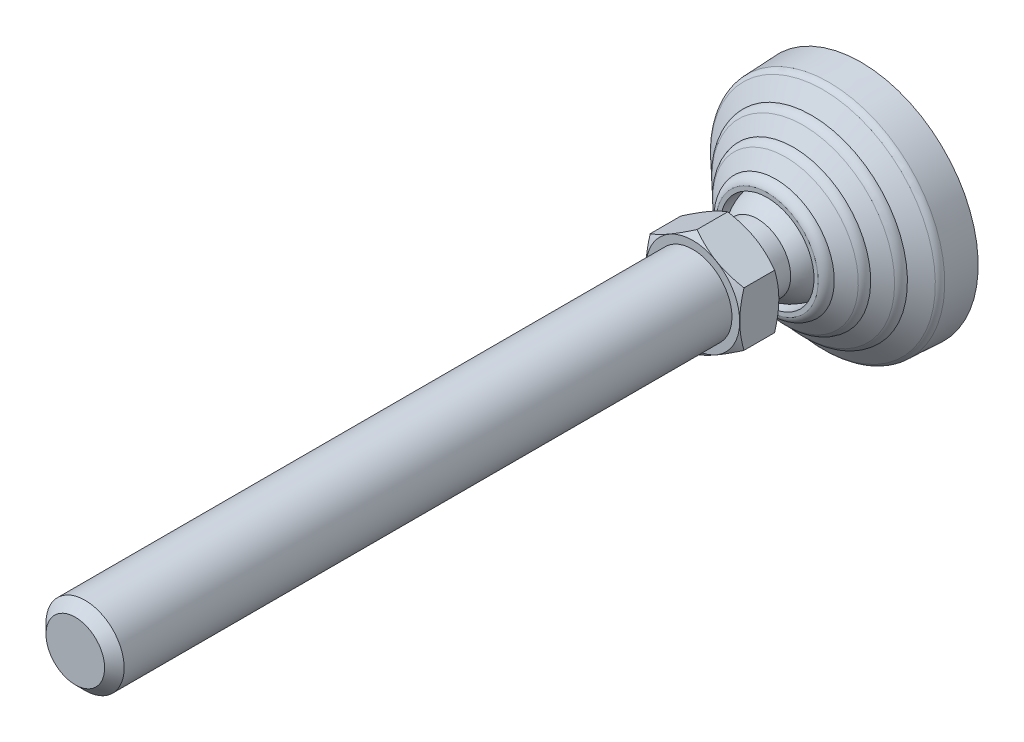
ISO-10303-21;
HEADER;
FILE_DESCRIPTION(('STEP AP214'),'2;1');
FILE_NAME('part.step','',(''),(''),'','','');
FILE_SCHEMA(('AUTOMOTIVE_DESIGN { 1 0 10303 214 1 1 1 1 }'));
ENDSEC;
DATA;
#1=APPLICATION_CONTEXT('core data for automotive mechanical design processes');
#2=APPLICATION_PROTOCOL_DEFINITION('international standard','automotive_design',2000,#1);
#3=PRODUCT_CONTEXT('',#1,'mechanical');
#4=PRODUCT('Part','Part','',(#3));
#5=PRODUCT_RELATED_PRODUCT_CATEGORY('part','',(#4));
#6=PRODUCT_DEFINITION_FORMATION('','',#4);
#7=PRODUCT_DEFINITION_CONTEXT('part definition',#1,'design');
#8=PRODUCT_DEFINITION('design','',#6,#7);
#9=PRODUCT_DEFINITION_SHAPE('','',#8);
#10=(LENGTH_UNIT() NAMED_UNIT(*) SI_UNIT(.MILLI.,.METRE.));
#11=(NAMED_UNIT(*) PLANE_ANGLE_UNIT() SI_UNIT($,.RADIAN.));
#12=(NAMED_UNIT(*) SI_UNIT($,.STERADIAN.) SOLID_ANGLE_UNIT());
#13=UNCERTAINTY_MEASURE_WITH_UNIT(LENGTH_MEASURE(1.E-05),#10,'distance_accuracy_value','');
#14=(GEOMETRIC_REPRESENTATION_CONTEXT(3) GLOBAL_UNCERTAINTY_ASSIGNED_CONTEXT((#13)) GLOBAL_UNIT_ASSIGNED_CONTEXT((#10,
#11,#12)) REPRESENTATION_CONTEXT('',''));
#15=CARTESIAN_POINT('',(0.,0.,0.));
#16=DIRECTION('',(0.,0.,1.));
#17=DIRECTION('',(1.,0.,0.));
#18=AXIS2_PLACEMENT_3D('',#15,#16,#17);
#19=CARTESIAN_POINT('',(0.,0.,110.4665));
#20=DIRECTION('',(0.,0.,-1.));
#21=DIRECTION('',(0.,1.,0.));
#22=AXIS2_PLACEMENT_3D('',#19,#20,#21);
#23=CYLINDRICAL_SURFACE('',#22,10.);
#24=CARTESIAN_POINT('',(0.,0.,198.5));
#25=DIRECTION('',(0.,0.,1.));
#26=DIRECTION('',(0.,-1.,0.));
#27=AXIS2_PLACEMENT_3D('',#24,#25,#26);
#28=CIRCLE('',#27,10.);
#29=CARTESIAN_POINT('',(0.,-10.,198.5));
#30=VERTEX_POINT('',#29);
#31=EDGE_CURVE('E9',#30,#30,#28,.F.);
#32=ORIENTED_EDGE('',*,*,#31,.T.);
#33=EDGE_LOOP('',(#32));
#34=FACE_BOUND('',#33,.T.);
#35=CARTESIAN_POINT('',(0.,0.,43.));
#36=DIRECTION('',(0.,0.,-1.));
#37=DIRECTION('',(0.,1.,0.));
#38=AXIS2_PLACEMENT_3D('',#35,#36,#37);
#39=CIRCLE('',#38,10.);
#40=CARTESIAN_POINT('',(0.,10.,43.));
#41=VERTEX_POINT('',#40);
#42=EDGE_CURVE('E124',#41,#41,#39,.F.);
#43=ORIENTED_EDGE('',*,*,#42,.T.);
#44=EDGE_LOOP('',(#43));
#45=FACE_BOUND('',#44,.T.);
#46=ADVANCED_FACE('F14',(#34,#45),#23,.T.);
#47=CARTESIAN_POINT('',(10.995,0.,43.));
#48=DIRECTION('',(0.,0.,1.));
#49=DIRECTION('',(0.,-1.,0.));
#50=AXIS2_PLACEMENT_3D('',#47,#48,#49);
#51=PLANE('',#50);
#52=CARTESIAN_POINT('',(0.,0.,43.));
#53=DIRECTION('',(0.,0.,-1.));
#54=DIRECTION('',(0.,1.,0.));
#55=AXIS2_PLACEMENT_3D('',#52,#53,#54);
#56=CIRCLE('',#55,11.99);
#57=CARTESIAN_POINT('',(0.,11.99,43.));
#58=VERTEX_POINT('',#57);
#59=EDGE_CURVE('E132',#58,#58,#56,.F.);
#60=ORIENTED_EDGE('',*,*,#59,.T.);
#61=EDGE_LOOP('',(#60));
#62=FACE_BOUND('',#61,.T.);
#63=ORIENTED_EDGE('',*,*,#42,.F.);
#64=EDGE_LOOP('',(#63));
#65=FACE_BOUND('',#64,.T.);
#66=ADVANCED_FACE('F157',(#62,#65),#51,.T.);
#67=CARTESIAN_POINT('',(0.,0.,41.9159643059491));
#68=DIRECTION('',(0.,0.,-1.));
#69=DIRECTION('',(0.,1.,0.));
#70=AXIS2_PLACEMENT_3D('',#67,#68,#69);
#71=CONICAL_SURFACE('',#70,13.8676048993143,1.0471975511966);
#72=ORIENTED_EDGE('',*,*,#59,.F.);
#73=EDGE_LOOP('',(#72));
#74=FACE_BOUND('',#73,.T.);
#75=CARTESIAN_POINT('',(-2.88482840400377E-08,-13.8564064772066,41.9224297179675));
#76=CARTESIAN_POINT('',(0.263784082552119,-13.7041106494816,42.0103407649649));
#77=CARTESIAN_POINT('',(0.528551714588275,-13.5512469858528,42.0942615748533));
#78=CARTESIAN_POINT('',(1.06021019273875,-13.2442938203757,42.2530155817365));
#79=CARTESIAN_POINT('',(1.32710170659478,-13.0902039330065,42.3278457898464));
#80=CARTESIAN_POINT('',(2.13207647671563,-12.6254515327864,42.537252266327));
#81=CARTESIAN_POINT('',(2.67333741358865,-12.3129543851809,42.6563603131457));
#82=CARTESIAN_POINT('',(3.48330954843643,-11.8453167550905,42.796023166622));
#83=CARTESIAN_POINT('',(3.74960108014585,-11.6915732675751,42.8358073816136));
#84=CARTESIAN_POINT('',(4.28341699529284,-11.3833745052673,42.9025217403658));
#85=CARTESIAN_POINT('',(4.55094140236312,-11.2289192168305,42.9294516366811));
#86=CARTESIAN_POINT('',(5.08643614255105,-10.9197511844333,42.9697675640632));
#87=CARTESIAN_POINT('',(5.35440556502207,-10.7650389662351,42.9831696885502));
#88=CARTESIAN_POINT('',(5.8905925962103,-10.4554712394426,42.996144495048));
#89=CARTESIAN_POINT('',(6.15881019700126,-10.3006157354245,42.9957176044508));
#90=CARTESIAN_POINT('',(6.66023029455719,-10.0111207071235,42.9820002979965));
#91=CARTESIAN_POINT('',(6.8934685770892,-9.87646052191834,42.97038309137));
#92=CARTESIAN_POINT('',(7.35940867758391,-9.60744987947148,42.9369099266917));
#93=CARTESIAN_POINT('',(7.59211045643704,-9.47309944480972,42.9150532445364));
#94=CARTESIAN_POINT('',(8.05685109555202,-9.20478131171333,42.8614821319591));
#95=CARTESIAN_POINT('',(8.28888924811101,-9.07081402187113,42.8297595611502));
#96=CARTESIAN_POINT('',(8.75187776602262,-8.80350747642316,42.7570131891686));
#97=CARTESIAN_POINT('',(8.9828280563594,-8.6701682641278,42.7159887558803));
#98=CARTESIAN_POINT('',(9.68388987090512,-8.26541003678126,42.5779256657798));
#99=CARTESIAN_POINT('',(10.1519713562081,-7.99516306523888,42.4671213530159));
#100=CARTESIAN_POINT('',(11.081155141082,-7.45869855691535,42.2156417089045));
#101=CARTESIAN_POINT('',(11.5422693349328,-7.19247415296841,42.075025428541));
#102=CARTESIAN_POINT('',(11.9999999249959,-6.92820327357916,41.922429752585));
#103=B_SPLINE_CURVE_WITH_KNOTS('',3,(#75,#76,#77,#78,#79,#80,#81,#82,#83,#84,#85,#86,#87,#88,
#89,#90,#91,#92,#93,#94,#95,#96,#97,#98,#99,#100,#101,#102),.UNSPECIFIED.,.F.,.F.,(4,2,2,2,2,2,
2,2,2,2,2,2,2,4),(0.,0.950996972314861,1.90230578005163,3.80897261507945,4.73890631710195,
5.66885791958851,6.59770188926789,7.52651715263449,8.33503482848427,9.14360968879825,
9.95285348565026,10.7621522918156,12.4163368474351,14.0672749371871),.UNSPECIFIED.);
#104=CARTESIAN_POINT('',(-1.44241383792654E-08,-13.8564064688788,41.9224297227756));
#105=VERTEX_POINT('',#104);
#106=CARTESIAN_POINT('',(12.,-6.92820324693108,41.9224297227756));
#107=VERTEX_POINT('',#106);
#108=EDGE_CURVE('E143',#105,#107,#103,.T.);
#109=ORIENTED_EDGE('',*,*,#108,.T.);
#110=CARTESIAN_POINT('',(12.,-6.92820326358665,41.9224297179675));
#111=CARTESIAN_POINT('',(12.,-6.64374493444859,42.0045333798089));
#112=CARTESIAN_POINT('',(12.,-6.35829458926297,42.0831531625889));
#113=CARTESIAN_POINT('',(12.,-5.78524260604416,42.2325348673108));
#114=CARTESIAN_POINT('',(12.,-5.49764024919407,42.3032940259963));
#115=CARTESIAN_POINT('',(12.,-4.63053083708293,42.5026195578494));
#116=CARTESIAN_POINT('',(12.,-4.04782834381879,42.6179071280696));
#117=CARTESIAN_POINT('',(12.,-3.17548925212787,42.7575170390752));
#118=CARTESIAN_POINT('',(12.,-2.88840964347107,42.7982045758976));
#119=CARTESIAN_POINT('',(12.,-2.31290718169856,42.8685767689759));
#120=CARTESIAN_POINT('',(12.,-2.02448443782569,42.8982623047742));
#121=CARTESIAN_POINT('',(12.,-1.44696804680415,42.9459902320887));
#122=CARTESIAN_POINT('',(12.,-1.15787537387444,42.9640443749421));
#123=CARTESIAN_POINT('',(12.,-0.579188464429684,42.9881624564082));
#124=CARTESIAN_POINT('',(12.,-0.289594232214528,42.994226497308));
#125=CARTESIAN_POINT('',(12.,0.289594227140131,42.9942264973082));
#126=CARTESIAN_POINT('',(12.,0.579188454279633,42.9881624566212));
#127=CARTESIAN_POINT('',(12.,1.15787535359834,42.9640443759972));
#128=CARTESIAN_POINT('',(12.,1.44696802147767,42.9459902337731));
#129=CARTESIAN_POINT('',(12.,2.02448440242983,42.8982623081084));
#130=CARTESIAN_POINT('',(12.,2.31290714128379,42.8685767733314));
#131=CARTESIAN_POINT('',(12.,2.88840959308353,42.798204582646));
#132=CARTESIAN_POINT('',(12.,3.17548919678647,42.7575170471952));
#133=CARTESIAN_POINT('',(12.,4.04782827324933,42.6179071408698));
#134=CARTESIAN_POINT('',(12.,4.63053075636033,42.5026195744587));
#135=CARTESIAN_POINT('',(12.,5.49764015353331,42.3032940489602));
#136=CARTESIAN_POINT('',(12.,5.78524250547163,42.2325348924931));
#137=CARTESIAN_POINT('',(12.,6.35829447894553,42.0831531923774));
#138=CARTESIAN_POINT('',(12.,6.64374481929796,42.004533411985));
#139=CARTESIAN_POINT('',(12.,6.92820314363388,41.9224297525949));
#140=B_SPLINE_CURVE_WITH_KNOTS('',3,(#110,#111,#112,#113,#114,#115,#116,#117,#118,#119,#120,
#121,#122,#123,#124,#125,#126,#127,#128,#129,#130,#131,#132,#133,#134,#135,#136,#137,#138,#139),
.UNSPECIFIED.,.F.,.F.,(4,2,2,2,2,2,2,2,2,2,2,2,2,2,4),(0.,0.888148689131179,1.77660860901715,
3.55698615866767,4.42666281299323,5.2962699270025,6.16499708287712,7.03371682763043,
7.90243655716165,8.7711636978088,9.64077079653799,10.5104474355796,12.2908249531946,
13.1792848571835,14.0674335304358),.UNSPECIFIED.);
#141=CARTESIAN_POINT('',(12.0000000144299,6.92820322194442,41.9224297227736));
#142=VERTEX_POINT('',#141);
#143=EDGE_CURVE('E135',#107,#142,#140,.T.);
#144=ORIENTED_EDGE('',*,*,#143,.T.);
#145=CARTESIAN_POINT('',(12.0000000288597,6.92820321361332,41.9224297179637));
#146=CARTESIAN_POINT('',(11.7362159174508,7.08049904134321,42.0103407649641));
#147=CARTESIAN_POINT('',(11.4714482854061,7.23336270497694,42.0942615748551));
#148=CARTESIAN_POINT('',(10.9397898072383,7.54031587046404,42.2530155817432));
#149=CARTESIAN_POINT('',(10.6728982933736,7.69440575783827,42.3278457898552));
#150=CARTESIAN_POINT('',(9.86792352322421,8.15915815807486,42.5372522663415));
#151=CARTESIAN_POINT('',(9.32666258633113,8.47165530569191,42.6563603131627));
#152=CARTESIAN_POINT('',(8.51669045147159,8.93929293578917,42.7960231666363));
#153=CARTESIAN_POINT('',(8.25039891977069,9.0930364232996,42.8358073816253));
#154=CARTESIAN_POINT('',(7.71658300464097,9.40123518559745,42.9025217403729));
#155=CARTESIAN_POINT('',(7.44905859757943,9.55569047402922,42.9294516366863));
#156=CARTESIAN_POINT('',(6.91356385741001,9.86485850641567,42.9697675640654));
#157=CARTESIAN_POINT('',(6.64559443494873,10.0195707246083,42.9831696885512));
#158=CARTESIAN_POINT('',(6.10940740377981,10.3291384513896,42.996144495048));
#159=CARTESIAN_POINT('',(5.84118980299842,10.4839939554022,42.9957176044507));
#160=CARTESIAN_POINT('',(5.33976970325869,10.773488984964,42.9820002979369));
#161=CARTESIAN_POINT('',(5.10653141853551,10.9081491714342,42.970383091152));
#162=CARTESIAN_POINT('',(4.64059131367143,11.1771598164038,42.9369099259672));
#163=CARTESIAN_POINT('',(4.4078895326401,11.3115102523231,42.9150532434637));
#164=CARTESIAN_POINT('',(3.94314888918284,11.5798283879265,42.8614821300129));
#165=CARTESIAN_POINT('',(3.71111073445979,11.7137956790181,42.8297595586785));
#166=CARTESIAN_POINT('',(3.24812221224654,11.9811022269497,42.7570131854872));
#167=CARTESIAN_POINT('',(3.01717191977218,12.1144414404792,42.7159887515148));
#168=CARTESIAN_POINT('',(2.31611009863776,12.5191996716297,42.5779256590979));
#169=CARTESIAN_POINT('',(1.84802860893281,12.7894466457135,42.4671213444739));
#170=CARTESIAN_POINT('',(0.918844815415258,13.3259111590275,42.2156416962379));
#171=CARTESIAN_POINT('',(0.457730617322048,13.5921355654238,42.0750254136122));
#172=CARTESIAN_POINT('',(2.30778996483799E-08,13.856406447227,41.9224297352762));
#173=B_SPLINE_CURVE_WITH_KNOTS('',3,(#145,#146,#147,#148,#149,#150,#151,#152,#153,#154,#155,
#156,#157,#158,#159,#160,#161,#162,#163,#164,#165,#166,#167,#168,#169,#170,#171,#172),
.UNSPECIFIED.,.F.,.F.,(4,2,2,2,2,2,2,2,2,2,2,2,2,4),(0.,0.95099697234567,1.9023057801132,
3.8089726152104,4.73890631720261,5.66885791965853,6.59770188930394,7.52651715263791,
8.33503483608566,9.14360970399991,9.95285350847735,10.7621523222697,12.4163368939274,
14.0672749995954),.UNSPECIFIED.);
#174=CARTESIAN_POINT('',(-1.15389591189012E-08,13.856406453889,41.92242973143));
#175=VERTEX_POINT('',#174);
#176=EDGE_CURVE('E180',#142,#175,#173,.T.);
#177=ORIENTED_EDGE('',*,*,#176,.T.);
#178=CARTESIAN_POINT('',(-2.30779115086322E-08,13.856406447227,41.9224297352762));
#179=CARTESIAN_POINT('',(-0.263784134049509,13.7041106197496,42.0103407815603));
#180=CARTESIAN_POINT('',(-0.528551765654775,13.5512469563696,42.0942615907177));
#181=CARTESIAN_POINT('',(-1.06021024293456,13.2442937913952,42.2530155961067));
#182=CARTESIAN_POINT('',(-1.32710175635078,13.0902039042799,42.3278458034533));
#183=CARTESIAN_POINT('',(-2.13207652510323,12.6254515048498,42.5372522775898));
#184=CARTESIAN_POINT('',(-2.6733374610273,12.3129543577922,42.656360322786));
#185=CARTESIAN_POINT('',(-3.48330959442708,11.8453167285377,42.7960231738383));
#186=CARTESIAN_POINT('',(-3.74960112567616,11.6915732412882,42.8358073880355));
#187=CARTESIAN_POINT('',(-4.28341703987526,11.3833744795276,42.9025217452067));
#188=CARTESIAN_POINT('',(-4.550941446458,11.2289191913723,42.9294516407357));
#189=CARTESIAN_POINT('',(-5.08643618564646,10.9197511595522,42.9697675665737));
#190=CARTESIAN_POINT('',(-5.35440560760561,10.7650389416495,42.9831696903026));
#191=CARTESIAN_POINT('',(-5.89059263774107,10.4554712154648,42.9961444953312));
#192=CARTESIAN_POINT('',(-6.15881023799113,10.300615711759,42.9957176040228));
#193=CARTESIAN_POINT('',(-6.66023033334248,10.0111206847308,42.9820002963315));
#194=CARTESIAN_POINT('',(-6.89346861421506,9.87646050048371,42.9703830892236));
#195=CARTESIAN_POINT('',(-7.359408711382,9.60744985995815,42.9369099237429));
#196=CARTESIAN_POINT('',(-7.59211048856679,9.4730994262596,42.9150532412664));
#197=CARTESIAN_POINT('',(-8.05685112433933,9.20478129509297,42.8614821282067));
#198=CARTESIAN_POINT('',(-8.28888927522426,9.07081400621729,42.8297595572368));
#199=CARTESIAN_POINT('',(-8.75187778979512,8.8035074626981,42.7570131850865));
#200=CARTESIAN_POINT('',(-8.98282807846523,8.67016825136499,42.7159887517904));
#201=CARTESIAN_POINT('',(-9.68388988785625,8.26541002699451,42.5779256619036));
#202=CARTESIAN_POINT('',(-10.1519713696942,7.9951630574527,42.4671213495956));
#203=CARTESIAN_POINT('',(-11.0811551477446,7.45869855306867,42.2156417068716));
#204=CARTESIAN_POINT('',(-11.5422693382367,7.19247415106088,42.0750254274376));
#205=CARTESIAN_POINT('',(-11.9999999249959,6.92820327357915,41.922429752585));
#206=B_SPLINE_CURVE_WITH_KNOTS('',3,(#178,#179,#180,#181,#182,#183,#184,#185,#186,#187,#188,
#189,#190,#191,#192,#193,#194,#195,#196,#197,#198,#199,#200,#201,#202,#203,#204,#205),
.UNSPECIFIED.,.F.,.F.,(4,2,2,2,2,2,2,2,2,2,2,2,2,4),(0.,0.9509969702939,1.90230577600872,
3.80897260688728,4.73890630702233,5.6688579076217,6.59770187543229,7.52651713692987,
8.33503480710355,9.14360966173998,9.95285345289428,10.7621522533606,12.4163367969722,
14.0672748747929),.UNSPECIFIED.);
#207=CARTESIAN_POINT('',(-12.,6.92820324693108,41.9224297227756));
#208=VERTEX_POINT('',#207);
#209=EDGE_CURVE('E172',#175,#208,#206,.T.);
#210=ORIENTED_EDGE('',*,*,#209,.T.);
#211=CARTESIAN_POINT('',(-12.,6.92820326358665,41.9224297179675));
#212=CARTESIAN_POINT('',(-12.,6.64374493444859,42.0045333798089));
#213=CARTESIAN_POINT('',(-12.,6.35829458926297,42.0831531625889));
#214=CARTESIAN_POINT('',(-12.,5.78524260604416,42.2325348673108));
#215=CARTESIAN_POINT('',(-12.,5.49764024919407,42.3032940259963));
#216=CARTESIAN_POINT('',(-12.,4.63053083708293,42.5026195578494));
#217=CARTESIAN_POINT('',(-12.,4.04782834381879,42.6179071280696));
#218=CARTESIAN_POINT('',(-12.,3.17548925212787,42.7575170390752));
#219=CARTESIAN_POINT('',(-12.,2.88840964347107,42.7982045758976));
#220=CARTESIAN_POINT('',(-12.,2.31290718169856,42.8685767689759));
#221=CARTESIAN_POINT('',(-12.,2.02448443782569,42.8982623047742));
#222=CARTESIAN_POINT('',(-12.,1.44696804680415,42.9459902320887));
#223=CARTESIAN_POINT('',(-12.,1.15787537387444,42.9640443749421));
#224=CARTESIAN_POINT('',(-12.,0.579188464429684,42.9881624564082));
#225=CARTESIAN_POINT('',(-12.,0.289594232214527,42.994226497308));
#226=CARTESIAN_POINT('',(-12.,-0.289594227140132,42.9942264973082));
#227=CARTESIAN_POINT('',(-12.,-0.579188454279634,42.9881624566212));
#228=CARTESIAN_POINT('',(-12.,-1.15787535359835,42.9640443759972));
#229=CARTESIAN_POINT('',(-12.,-1.44696802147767,42.9459902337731));
#230=CARTESIAN_POINT('',(-12.,-2.02448440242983,42.8982623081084));
#231=CARTESIAN_POINT('',(-12.,-2.31290714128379,42.8685767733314));
#232=CARTESIAN_POINT('',(-12.,-2.88840959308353,42.798204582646));
#233=CARTESIAN_POINT('',(-12.,-3.17548919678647,42.7575170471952));
#234=CARTESIAN_POINT('',(-12.,-4.04782827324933,42.6179071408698));
#235=CARTESIAN_POINT('',(-12.,-4.63053075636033,42.5026195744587));
#236=CARTESIAN_POINT('',(-12.,-5.49764015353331,42.3032940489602));
#237=CARTESIAN_POINT('',(-12.,-5.78524250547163,42.2325348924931));
#238=CARTESIAN_POINT('',(-12.,-6.35829447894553,42.0831531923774));
#239=CARTESIAN_POINT('',(-12.,-6.64374481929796,42.004533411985));
#240=CARTESIAN_POINT('',(-12.,-6.92820314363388,41.9224297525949));
#241=B_SPLINE_CURVE_WITH_KNOTS('',3,(#211,#212,#213,#214,#215,#216,#217,#218,#219,#220,#221,
#222,#223,#224,#225,#226,#227,#228,#229,#230,#231,#232,#233,#234,#235,#236,#237,#238,#239,#240),
.UNSPECIFIED.,.F.,.F.,(4,2,2,2,2,2,2,2,2,2,2,2,2,2,4),(0.,0.888148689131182,1.77660860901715,
3.55698615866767,4.42666281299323,5.2962699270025,6.16499708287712,7.03371682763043,
7.90243655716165,8.7711636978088,9.64077079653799,10.5104474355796,12.2908249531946,
13.1792848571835,14.0674335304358),.UNSPECIFIED.);
#242=CARTESIAN_POINT('',(-12.0000000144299,-6.92820322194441,41.9224297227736));
#243=VERTEX_POINT('',#242);
#244=EDGE_CURVE('E342',#208,#243,#241,.T.);
#245=ORIENTED_EDGE('',*,*,#244,.T.);
#246=CARTESIAN_POINT('',(-12.0000000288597,-6.92820321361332,41.9224297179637));
#247=CARTESIAN_POINT('',(-11.7362159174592,-7.08049904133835,42.0103407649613));
#248=CARTESIAN_POINT('',(-11.471448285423,-7.23336270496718,42.0942615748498));
#249=CARTESIAN_POINT('',(-10.9397898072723,-7.54031587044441,42.2530155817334));
#250=CARTESIAN_POINT('',(-10.6728982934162,-7.69440575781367,42.3278457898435));
#251=CARTESIAN_POINT('',(-9.86792352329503,-8.15915815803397,42.5372522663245));
#252=CARTESIAN_POINT('',(-9.3266625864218,-8.47165530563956,42.6563603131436));
#253=CARTESIAN_POINT('',(-8.5166904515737,-8.93929293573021,42.7960231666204));
#254=CARTESIAN_POINT('',(-8.25039891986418,-9.09303642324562,42.8358073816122));
#255=CARTESIAN_POINT('',(-7.71658300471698,-9.40123518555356,42.9025217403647));
#256=CARTESIAN_POINT('',(-7.44905859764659,-9.55569047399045,42.9294516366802));
#257=CARTESIAN_POINT('',(-6.91356385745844,-9.8648585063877,42.9697675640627));
#258=CARTESIAN_POINT('',(-6.64559443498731,-10.019570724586,42.9831696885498));
#259=CARTESIAN_POINT('',(-6.10940740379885,-10.3291384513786,42.996144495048));
#260=CARTESIAN_POINT('',(-5.84118980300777,-10.4839939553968,42.9957176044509));
#261=CARTESIAN_POINT('',(-5.33976970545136,-10.7734889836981,42.9820002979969));
#262=CARTESIAN_POINT('',(-5.10653142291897,-10.9081491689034,42.9703830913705));
#263=CARTESIAN_POINT('',(-4.64059132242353,-11.1771598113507,42.9369099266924));
#264=CARTESIAN_POINT('',(-4.40788954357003,-11.3115102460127,42.9150532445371));
#265=CARTESIAN_POINT('',(-3.94314890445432,-11.5798283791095,42.8614821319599));
#266=CARTESIAN_POINT('',(-3.71111075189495,-11.7137956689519,42.829759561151));
#267=CARTESIAN_POINT('',(-3.24812223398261,-11.9811022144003,42.7570131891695));
#268=CARTESIAN_POINT('',(-3.01717194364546,-12.1144414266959,42.7159887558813));
#269=CARTESIAN_POINT('',(-2.3161101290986,-12.5191996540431,42.5779256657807));
#270=CARTESIAN_POINT('',(-1.84802864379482,-12.7894466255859,42.4671213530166));
#271=CARTESIAN_POINT('',(-0.918844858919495,-13.3259111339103,42.215641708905));
#272=CARTESIAN_POINT('',(-0.457730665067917,-13.5921355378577,42.0750254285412));
#273=CARTESIAN_POINT('',(-7.50040961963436E-08,-13.8564064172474,41.922429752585));
#274=B_SPLINE_CURVE_WITH_KNOTS('',3,(#246,#247,#248,#249,#250,#251,#252,#253,#254,#255,#256,
#257,#258,#259,#260,#261,#262,#263,#264,#265,#266,#267,#268,#269,#270,#271,#272,#273),
.UNSPECIFIED.,.F.,.F.,(4,2,2,2,2,2,2,2,2,2,2,2,2,4),(0.,0.950996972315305,1.90230578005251,
3.80897261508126,4.73890631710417,5.66885791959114,6.59770188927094,7.52651715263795,
8.33503482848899,9.14360968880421,9.95285348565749,10.7621522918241,12.4163368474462,
14.0672749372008),.UNSPECIFIED.);
#275=EDGE_CURVE('E162',#243,#105,#274,.T.);
#276=ORIENTED_EDGE('',*,*,#275,.T.);
#277=EDGE_LOOP('',(#109,#144,#177,#210,#245,#276));
#278=FACE_BOUND('',#277,.T.);
#279=ADVANCED_FACE('F152',(#74,#278),#71,.T.);
#280=CARTESIAN_POINT('',(0.,-13.856406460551,43.1));
#281=DIRECTION('',(0.5,0.866025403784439,0.));
#282=DIRECTION('',(-0.866025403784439,0.5,0.));
#283=AXIS2_PLACEMENT_3D('',#280,#281,#282);
#284=PLANE('',#283);
#285=DIRECTION('',(0.,0.,1.));
#286=VECTOR('',#285,1.);
#287=CARTESIAN_POINT('',(0.,-13.856406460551,43.1));
#288=LINE('',#287,#286);
#289=CARTESIAN_POINT('',(0.,-13.856406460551,34.0775702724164));
#290=VERTEX_POINT('',#289);
#291=EDGE_CURVE('E368',#290,#105,#288,.T.);
#292=ORIENTED_EDGE('',*,*,#291,.T.);
#293=ORIENTED_EDGE('',*,*,#275,.F.);
#294=DIRECTION('',(0.,0.,1.));
#295=VECTOR('',#294,1.);
#296=CARTESIAN_POINT('',(-12.,-6.9282032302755,43.1));
#297=LINE('',#296,#295);
#298=CARTESIAN_POINT('',(-12.,-6.9282032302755,34.0775702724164));
#299=VERTEX_POINT('',#298);
#300=EDGE_CURVE('E360',#299,#243,#297,.T.);
#301=ORIENTED_EDGE('',*,*,#300,.F.);
#302=CARTESIAN_POINT('',(0.,-13.856406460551,34.0775702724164));
#303=CARTESIAN_POINT('',(-0.263784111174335,-13.7041106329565,33.9896592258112));
#304=CARTESIAN_POINT('',(-0.528551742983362,-13.5512469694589,33.9057384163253));
#305=CARTESIAN_POINT('',(-1.0602102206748,-13.2442938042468,33.7469844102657));
#306=CARTESIAN_POINT('',(-1.32710173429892,-13.0902039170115,33.6721542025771));
#307=CARTESIAN_POINT('',(-2.13207650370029,-12.6254515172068,33.4627477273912));
#308=CARTESIAN_POINT('',(-2.67333744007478,-12.3129543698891,33.3436396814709));
#309=CARTESIAN_POINT('',(-3.48330957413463,-11.8453167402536,33.2039768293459));
#310=CARTESIAN_POINT('',(-3.74960110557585,-11.6915732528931,33.1641926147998));
#311=CARTESIAN_POINT('',(-4.28341702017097,-11.3833744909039,33.097478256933));
#312=CARTESIAN_POINT('',(-4.55094142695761,-11.2289192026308,33.0705483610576));
#313=CARTESIAN_POINT('',(-5.08643616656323,-10.9197511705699,33.0302324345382));
#314=CARTESIAN_POINT('',(-5.35440558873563,-10.765038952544,33.0168303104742));
#315=CARTESIAN_POINT('',(-5.89059261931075,-10.4554712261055,33.0038555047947));
#316=CARTESIAN_POINT('',(-6.15881021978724,-10.300615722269,33.0042823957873));
#317=CARTESIAN_POINT('',(-6.66023031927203,-10.0111206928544,33.0179997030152));
#318=CARTESIAN_POINT('',(-6.8934686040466,-9.87646050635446,33.029616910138));
#319=CARTESIAN_POINT('',(-7.35940870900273,-9.6074498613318,33.063090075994));
#320=CARTESIAN_POINT('',(-7.59211049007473,-9.47309942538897,33.0849467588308));
#321=CARTESIAN_POINT('',(-8.05685113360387,-9.20478128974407,33.1385178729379));
#322=CARTESIAN_POINT('',(-8.28888928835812,-9.07081399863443,33.1702404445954));
#323=CARTESIAN_POINT('',(-8.75187781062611,-8.8035074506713,33.2429868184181));
#324=CARTESIAN_POINT('',(-8.98282810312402,-8.67016823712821,33.2840112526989));
#325=CARTESIAN_POINT('',(-9.6838899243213,-8.2654100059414,33.4220743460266));
#326=CARTESIAN_POINT('',(-10.1519714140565,-7.99516303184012,33.5328786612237));
#327=CARTESIAN_POINT('',(-11.0811552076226,-7.45869851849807,33.7843583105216));
#328=CARTESIAN_POINT('',(-11.5422694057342,-7.19247411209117,33.924974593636));
#329=CARTESIAN_POINT('',(-12.,-6.9282032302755,34.0775702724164));
#330=B_SPLINE_CURVE_WITH_KNOTS('',3,(#302,#303,#304,#305,#306,#307,#308,#309,#310,#311,#312,
#313,#314,#315,#316,#317,#318,#319,#320,#321,#322,#323,#324,#325,#326,#327,#328,#329),
.UNSPECIFIED.,.F.,.F.,(4,2,2,2,2,2,2,2,2,2,2,2,2,4),(0.,0.950996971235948,1.90230577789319,
3.80897261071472,4.73890631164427,5.66885791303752,6.59770188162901,7.52651714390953,
8.33503482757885,9.14360969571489,9.9528535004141,10.7621523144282,12.4163368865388,
14.0672749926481),.UNSPECIFIED.);
#331=EDGE_CURVE('E362',#290,#299,#330,.T.);
#332=ORIENTED_EDGE('',*,*,#331,.F.);
#333=EDGE_LOOP('',(#292,#293,#301,#332));
#334=FACE_BOUND('',#333,.T.);
#335=ADVANCED_FACE('F156',(#334),#284,.F.);
#336=CARTESIAN_POINT('',(12.,-6.92820323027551,43.1));
#337=DIRECTION('',(-0.5,0.866025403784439,0.));
#338=DIRECTION('',(-0.866025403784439,-0.5,0.));
#339=AXIS2_PLACEMENT_3D('',#336,#337,#338);
#340=PLANE('',#339);
#341=DIRECTION('',(0.,0.,1.));
#342=VECTOR('',#341,1.);
#343=CARTESIAN_POINT('',(12.,-6.92820323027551,43.1));
#344=LINE('',#343,#342);
#345=CARTESIAN_POINT('',(12.,-6.92820323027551,34.0775702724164));
#346=VERTEX_POINT('',#345);
#347=EDGE_CURVE('E31',#346,#107,#344,.T.);
#348=ORIENTED_EDGE('',*,*,#347,.T.);
#349=ORIENTED_EDGE('',*,*,#108,.F.);
#350=ORIENTED_EDGE('',*,*,#291,.F.);
#351=CARTESIAN_POINT('',(12.,-6.92820323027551,34.0775702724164));
#352=CARTESIAN_POINT('',(11.7362158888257,-7.08049905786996,33.9896592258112));
#353=CARTESIAN_POINT('',(11.4714482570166,-7.2333627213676,33.9057384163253));
#354=CARTESIAN_POINT('',(10.9397897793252,-7.5403158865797,33.7469844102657));
#355=CARTESIAN_POINT('',(10.6728982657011,-7.69440577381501,33.6721542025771));
#356=CARTESIAN_POINT('',(9.86792349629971,-8.15915817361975,33.4627477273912));
#357=CARTESIAN_POINT('',(9.32666255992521,-8.4716553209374,33.3436396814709));
#358=CARTESIAN_POINT('',(8.51669042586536,-8.93929295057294,33.2039768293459));
#359=CARTESIAN_POINT('',(8.25039889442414,-9.09303643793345,33.1641926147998));
#360=CARTESIAN_POINT('',(7.71658297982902,-9.40123519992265,33.097478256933));
#361=CARTESIAN_POINT('',(7.44905857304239,-9.55569048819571,33.0705483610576));
#362=CARTESIAN_POINT('',(6.91356383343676,-9.86485852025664,33.0302324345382));
#363=CARTESIAN_POINT('',(6.64559441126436,-10.0195707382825,33.0168303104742));
#364=CARTESIAN_POINT('',(6.10940738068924,-10.329138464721,33.0038555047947));
#365=CARTESIAN_POINT('',(5.84118978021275,-10.4839939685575,33.0042823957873));
#366=CARTESIAN_POINT('',(5.33976968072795,-10.7734889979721,33.0179997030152));
#367=CARTESIAN_POINT('',(5.10653139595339,-10.9081491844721,33.029616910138));
#368=CARTESIAN_POINT('',(4.64059129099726,-11.1771598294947,33.063090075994));
#369=CARTESIAN_POINT('',(4.40788950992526,-11.3115102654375,33.0849467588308));
#370=CARTESIAN_POINT('',(3.94314886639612,-11.5798284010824,33.1385178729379));
#371=CARTESIAN_POINT('',(3.71111071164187,-11.7137956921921,33.1702404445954));
#372=CARTESIAN_POINT('',(3.24812218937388,-11.9811022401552,33.2429868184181));
#373=CARTESIAN_POINT('',(3.01717189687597,-12.1144414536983,33.2840112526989));
#374=CARTESIAN_POINT('',(2.3161100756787,-12.5191996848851,33.4220743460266));
#375=CARTESIAN_POINT('',(1.84802858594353,-12.7894466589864,33.5328786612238));
#376=CARTESIAN_POINT('',(0.918844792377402,-13.3259111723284,33.7843583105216));
#377=CARTESIAN_POINT('',(0.457730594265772,-13.5921355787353,33.924974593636));
#378=CARTESIAN_POINT('',(0.,-13.856406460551,34.0775702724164));
#379=B_SPLINE_CURVE_WITH_KNOTS('',3,(#351,#352,#353,#354,#355,#356,#357,#358,#359,#360,#361,
#362,#363,#364,#365,#366,#367,#368,#369,#370,#371,#372,#373,#374,#375,#376,#377,#378),
.UNSPECIFIED.,.F.,.F.,(4,2,2,2,2,2,2,2,2,2,2,2,2,4),(0.,0.95099697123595,1.90230577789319,
3.80897261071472,4.73890631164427,5.66885791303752,6.59770188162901,7.52651714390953,
8.33503482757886,9.14360969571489,9.9528535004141,10.7621523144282,12.4163368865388,
14.0672749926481),.UNSPECIFIED.);
#380=EDGE_CURVE('E369',#346,#290,#379,.T.);
#381=ORIENTED_EDGE('',*,*,#380,.F.);
#382=EDGE_LOOP('',(#348,#349,#350,#381));
#383=FACE_BOUND('',#382,.T.);
#384=ADVANCED_FACE('F375',(#383),#340,.F.);
#385=CARTESIAN_POINT('',(-12.,6.92820323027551,43.1));
#386=DIRECTION('',(0.5,-0.866025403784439,0.));
#387=DIRECTION('',(0.866025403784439,0.5,0.));
#388=AXIS2_PLACEMENT_3D('',#385,#386,#387);
#389=PLANE('',#388);
#390=DIRECTION('',(0.,0.,1.));
#391=VECTOR('',#390,1.);
#392=CARTESIAN_POINT('',(-12.,6.92820323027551,43.1));
#393=LINE('',#392,#391);
#394=CARTESIAN_POINT('',(-12.,6.92820323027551,34.0775702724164));
#395=VERTEX_POINT('',#394);
#396=EDGE_CURVE('E361',#395,#208,#393,.T.);
#397=ORIENTED_EDGE('',*,*,#396,.T.);
#398=ORIENTED_EDGE('',*,*,#209,.F.);
#399=DIRECTION('',(0.,0.,1.));
#400=VECTOR('',#399,1.);
#401=CARTESIAN_POINT('',(0.,13.856406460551,43.1));
#402=LINE('',#401,#400);
#403=CARTESIAN_POINT('',(0.,13.856406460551,34.0775702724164));
#404=VERTEX_POINT('',#403);
#405=EDGE_CURVE('E211',#404,#175,#402,.T.);
#406=ORIENTED_EDGE('',*,*,#405,.F.);
#407=CARTESIAN_POINT('',(-12.,6.92820323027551,34.0775702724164));
#408=CARTESIAN_POINT('',(-11.7362158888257,7.08049905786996,33.9896592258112));
#409=CARTESIAN_POINT('',(-11.4714482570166,7.2333627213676,33.9057384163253));
#410=CARTESIAN_POINT('',(-10.9397897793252,7.5403158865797,33.7469844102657));
#411=CARTESIAN_POINT('',(-10.6728982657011,7.69440577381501,33.6721542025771));
#412=CARTESIAN_POINT('',(-9.86792349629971,8.15915817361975,33.4627477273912));
#413=CARTESIAN_POINT('',(-9.32666255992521,8.4716553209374,33.3436396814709));
#414=CARTESIAN_POINT('',(-8.51669042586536,8.93929295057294,33.2039768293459));
#415=CARTESIAN_POINT('',(-8.25039889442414,9.09303643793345,33.1641926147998));
#416=CARTESIAN_POINT('',(-7.71658297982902,9.40123519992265,33.097478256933));
#417=CARTESIAN_POINT('',(-7.44905857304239,9.55569048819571,33.0705483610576));
#418=CARTESIAN_POINT('',(-6.91356383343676,9.86485852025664,33.0302324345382));
#419=CARTESIAN_POINT('',(-6.64559441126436,10.0195707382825,33.0168303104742));
#420=CARTESIAN_POINT('',(-6.10940738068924,10.329138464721,33.0038555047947));
#421=CARTESIAN_POINT('',(-5.84118978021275,10.4839939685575,33.0042823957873));
#422=CARTESIAN_POINT('',(-5.33976968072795,10.7734889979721,33.0179997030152));
#423=CARTESIAN_POINT('',(-5.10653139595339,10.9081491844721,33.029616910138));
#424=CARTESIAN_POINT('',(-4.64059129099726,11.1771598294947,33.063090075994));
#425=CARTESIAN_POINT('',(-4.40788950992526,11.3115102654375,33.0849467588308));
#426=CARTESIAN_POINT('',(-3.94314886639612,11.5798284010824,33.1385178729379));
#427=CARTESIAN_POINT('',(-3.71111071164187,11.7137956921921,33.1702404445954));
#428=CARTESIAN_POINT('',(-3.24812218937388,11.9811022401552,33.2429868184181));
#429=CARTESIAN_POINT('',(-3.01717189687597,12.1144414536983,33.2840112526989));
#430=CARTESIAN_POINT('',(-2.3161100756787,12.5191996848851,33.4220743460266));
#431=CARTESIAN_POINT('',(-1.84802858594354,12.7894466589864,33.5328786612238));
#432=CARTESIAN_POINT('',(-0.918844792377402,13.3259111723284,33.7843583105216));
#433=CARTESIAN_POINT('',(-0.457730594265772,13.5921355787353,33.924974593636));
#434=CARTESIAN_POINT('',(0.,13.856406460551,34.0775702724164));
#435=B_SPLINE_CURVE_WITH_KNOTS('',3,(#407,#408,#409,#410,#411,#412,#413,#414,#415,#416,#417,
#418,#419,#420,#421,#422,#423,#424,#425,#426,#427,#428,#429,#430,#431,#432,#433,#434),
.UNSPECIFIED.,.F.,.F.,(4,2,2,2,2,2,2,2,2,2,2,2,2,4),(0.,0.95099697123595,1.90230577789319,
3.80897261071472,4.73890631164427,5.66885791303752,6.59770188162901,7.52651714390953,
8.33503482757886,9.14360969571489,9.9528535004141,10.7621523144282,12.4163368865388,
14.0672749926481),.UNSPECIFIED.);
#436=EDGE_CURVE('E213',#395,#404,#435,.T.);
#437=ORIENTED_EDGE('',*,*,#436,.F.);
#438=EDGE_LOOP('',(#397,#398,#406,#437));
#439=FACE_BOUND('',#438,.T.);
#440=ADVANCED_FACE('F199',(#439),#389,.F.);
#441=CARTESIAN_POINT('',(-12.,-6.92820323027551,43.1));
#442=DIRECTION('',(1.,0.,0.));
#443=DIRECTION('',(0.,1.,0.));
#444=AXIS2_PLACEMENT_3D('',#441,#442,#443);
#445=PLANE('',#444);
#446=ORIENTED_EDGE('',*,*,#300,.T.);
#447=ORIENTED_EDGE('',*,*,#244,.F.);
#448=ORIENTED_EDGE('',*,*,#396,.F.);
#449=CARTESIAN_POINT('',(-12.,-6.9282032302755,34.0775702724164));
#450=CARTESIAN_POINT('',(-12.,-6.64374490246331,33.9954666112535));
#451=CARTESIAN_POINT('',(-12.,-6.35829455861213,33.9168468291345));
#452=CARTESIAN_POINT('',(-12.,-5.78524257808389,33.7674651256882));
#453=CARTESIAN_POINT('',(-12.,-5.49764022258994,33.6967059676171));
#454=CARTESIAN_POINT('',(-12.,-4.63053081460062,33.4973804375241));
#455=CARTESIAN_POINT('',(-12.,-4.04782832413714,33.3820928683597));
#456=CARTESIAN_POINT('',(-12.,-3.17548923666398,33.2424829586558));
#457=CARTESIAN_POINT('',(-12.,-2.88840962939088,33.2017954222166));
#458=CARTESIAN_POINT('',(-12.,-2.31290717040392,33.1314232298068));
#459=CARTESIAN_POINT('',(-12.,-2.02448442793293,33.1017376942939));
#460=CARTESIAN_POINT('',(-12.,-1.44696803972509,33.0540097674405));
#461=CARTESIAN_POINT('',(-12.,-1.1578753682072,33.035955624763));
#462=CARTESIAN_POINT('',(-12.,-0.579188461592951,33.0118375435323));
#463=CARTESIAN_POINT('',(-12.,-0.289594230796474,33.0057735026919));
#464=CARTESIAN_POINT('',(-12.,0.28959423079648,33.0057735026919));
#465=CARTESIAN_POINT('',(-12.,0.579188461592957,33.0118375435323));
#466=CARTESIAN_POINT('',(-12.,1.15787536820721,33.035955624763));
#467=CARTESIAN_POINT('',(-12.,1.4469680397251,33.0540097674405));
#468=CARTESIAN_POINT('',(-12.,2.02448442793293,33.1017376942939));
#469=CARTESIAN_POINT('',(-12.,2.31290717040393,33.1314232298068));
#470=CARTESIAN_POINT('',(-12.,2.88840962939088,33.2017954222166));
#471=CARTESIAN_POINT('',(-12.,3.17548923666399,33.2424829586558));
#472=CARTESIAN_POINT('',(-12.,4.04782832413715,33.3820928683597));
#473=CARTESIAN_POINT('',(-12.,4.63053081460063,33.4973804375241));
#474=CARTESIAN_POINT('',(-12.,5.49764022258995,33.6967059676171));
#475=CARTESIAN_POINT('',(-12.,5.7852425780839,33.7674651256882));
#476=CARTESIAN_POINT('',(-12.,6.35829455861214,33.9168468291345));
#477=CARTESIAN_POINT('',(-12.,6.64374490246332,33.9954666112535));
#478=CARTESIAN_POINT('',(-12.,6.92820323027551,34.0775702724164));
#479=B_SPLINE_CURVE_WITH_KNOTS('',3,(#449,#450,#451,#452,#453,#454,#455,#456,#457,#458,#459,
#460,#461,#462,#463,#464,#465,#466,#467,#468,#469,#470,#471,#472,#473,#474,#475,#476,#477,#478),
.UNSPECIFIED.,.F.,.F.,(4,2,2,2,2,2,2,2,2,2,2,2,2,2,4),(0.,0.888148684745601,1.77660860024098,
3.55698614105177,4.42666279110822,5.29626990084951,6.16499705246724,7.03371679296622,
7.90243653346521,8.77116368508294,9.64077079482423,10.5104474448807,12.2908249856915,
13.1792849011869,14.0674335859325),.UNSPECIFIED.);
#480=EDGE_CURVE('E354',#299,#395,#479,.T.);
#481=ORIENTED_EDGE('',*,*,#480,.F.);
#482=EDGE_LOOP('',(#446,#447,#448,#481));
#483=FACE_BOUND('',#482,.T.);
#484=ADVANCED_FACE('F348',(#483),#445,.F.);
#485=CARTESIAN_POINT('',(12.,6.92820323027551,43.1));
#486=DIRECTION('',(-1.,0.,0.));
#487=DIRECTION('',(0.,-1.,0.));
#488=AXIS2_PLACEMENT_3D('',#485,#486,#487);
#489=PLANE('',#488);
#490=DIRECTION('',(0.,0.,1.));
#491=VECTOR('',#490,1.);
#492=CARTESIAN_POINT('',(12.,6.92820323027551,43.1));
#493=LINE('',#492,#491);
#494=CARTESIAN_POINT('',(12.,6.9282032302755,34.0775702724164));
#495=VERTEX_POINT('',#494);
#496=EDGE_CURVE('E402',#142,#495,#493,.F.);
#497=ORIENTED_EDGE('',*,*,#496,.F.);
#498=ORIENTED_EDGE('',*,*,#143,.F.);
#499=ORIENTED_EDGE('',*,*,#347,.F.);
#500=CARTESIAN_POINT('',(12.,6.92820323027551,34.0775702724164));
#501=CARTESIAN_POINT('',(12.,6.64374490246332,33.9954666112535));
#502=CARTESIAN_POINT('',(12.,6.35829455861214,33.9168468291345));
#503=CARTESIAN_POINT('',(12.,5.7852425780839,33.7674651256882));
#504=CARTESIAN_POINT('',(12.,5.49764022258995,33.6967059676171));
#505=CARTESIAN_POINT('',(12.,4.63053081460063,33.4973804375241));
#506=CARTESIAN_POINT('',(12.,4.04782832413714,33.3820928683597));
#507=CARTESIAN_POINT('',(12.,3.17548923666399,33.2424829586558));
#508=CARTESIAN_POINT('',(12.,2.88840962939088,33.2017954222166));
#509=CARTESIAN_POINT('',(12.,2.31290717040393,33.1314232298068));
#510=CARTESIAN_POINT('',(12.,2.02448442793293,33.1017376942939));
#511=CARTESIAN_POINT('',(12.,1.4469680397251,33.0540097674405));
#512=CARTESIAN_POINT('',(12.,1.1578753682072,33.035955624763));
#513=CARTESIAN_POINT('',(12.,0.579188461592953,33.0118375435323));
#514=CARTESIAN_POINT('',(12.,0.289594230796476,33.0057735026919));
#515=CARTESIAN_POINT('',(12.,-0.289594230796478,33.0057735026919));
#516=CARTESIAN_POINT('',(12.,-0.579188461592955,33.0118375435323));
#517=CARTESIAN_POINT('',(12.,-1.15787536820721,33.035955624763));
#518=CARTESIAN_POINT('',(12.,-1.4469680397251,33.0540097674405));
#519=CARTESIAN_POINT('',(12.,-2.02448442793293,33.1017376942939));
#520=CARTESIAN_POINT('',(12.,-2.31290717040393,33.1314232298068));
#521=CARTESIAN_POINT('',(12.,-2.88840962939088,33.2017954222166));
#522=CARTESIAN_POINT('',(12.,-3.17548923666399,33.2424829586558));
#523=CARTESIAN_POINT('',(12.,-4.04782832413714,33.3820928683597));
#524=CARTESIAN_POINT('',(12.,-4.63053081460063,33.4973804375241));
#525=CARTESIAN_POINT('',(12.,-5.49764022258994,33.6967059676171));
#526=CARTESIAN_POINT('',(12.,-5.78524257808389,33.7674651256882));
#527=CARTESIAN_POINT('',(12.,-6.35829455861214,33.9168468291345));
#528=CARTESIAN_POINT('',(12.,-6.64374490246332,33.9954666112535));
#529=CARTESIAN_POINT('',(12.,-6.92820323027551,34.0775702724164));
#530=B_SPLINE_CURVE_WITH_KNOTS('',3,(#500,#501,#502,#503,#504,#505,#506,#507,#508,#509,#510,
#511,#512,#513,#514,#515,#516,#517,#518,#519,#520,#521,#522,#523,#524,#525,#526,#527,#528,#529),
.UNSPECIFIED.,.F.,.F.,(4,2,2,2,2,2,2,2,2,2,2,2,2,2,4),(0.,0.888148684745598,1.77660860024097,
3.55698614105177,4.42666279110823,5.29626990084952,6.16499705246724,7.03371679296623,
7.90243653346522,8.77116368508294,9.64077079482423,10.5104474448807,12.2908249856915,
13.1792849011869,14.0674335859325),.UNSPECIFIED.);
#531=EDGE_CURVE('E188',#495,#346,#530,.T.);
#532=ORIENTED_EDGE('',*,*,#531,.F.);
#533=EDGE_LOOP('',(#497,#498,#499,#532));
#534=FACE_BOUND('',#533,.T.);
#535=ADVANCED_FACE('F150',(#534),#489,.F.);
#536=CARTESIAN_POINT('',(0.,13.856406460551,43.1));
#537=DIRECTION('',(-0.5,-0.866025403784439,0.));
#538=DIRECTION('',(0.866025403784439,-0.5,0.));
#539=AXIS2_PLACEMENT_3D('',#536,#537,#538);
#540=PLANE('',#539);
#541=ORIENTED_EDGE('',*,*,#405,.T.);
#542=ORIENTED_EDGE('',*,*,#176,.F.);
#543=ORIENTED_EDGE('',*,*,#496,.T.);
#544=CARTESIAN_POINT('',(0.,13.856406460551,34.0775702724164));
#545=CARTESIAN_POINT('',(0.263784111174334,13.7041106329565,33.9896592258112));
#546=CARTESIAN_POINT('',(0.528551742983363,13.5512469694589,33.9057384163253));
#547=CARTESIAN_POINT('',(1.0602102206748,13.2442938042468,33.7469844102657));
#548=CARTESIAN_POINT('',(1.32710173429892,13.0902039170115,33.6721542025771));
#549=CARTESIAN_POINT('',(2.13207650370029,12.6254515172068,33.4627477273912));
#550=CARTESIAN_POINT('',(2.67333744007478,12.3129543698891,33.3436396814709));
#551=CARTESIAN_POINT('',(3.48330957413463,11.8453167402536,33.2039768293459));
#552=CARTESIAN_POINT('',(3.74960110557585,11.6915732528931,33.1641926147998));
#553=CARTESIAN_POINT('',(4.28341702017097,11.3833744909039,33.097478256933));
#554=CARTESIAN_POINT('',(4.55094142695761,11.2289192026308,33.0705483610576));
#555=CARTESIAN_POINT('',(5.08643616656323,10.9197511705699,33.0302324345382));
#556=CARTESIAN_POINT('',(5.35440558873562,10.765038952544,33.0168303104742));
#557=CARTESIAN_POINT('',(5.89059261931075,10.4554712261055,33.0038555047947));
#558=CARTESIAN_POINT('',(6.15881021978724,10.300615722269,33.0042823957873));
#559=CARTESIAN_POINT('',(6.66023031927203,10.0111206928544,33.0179997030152));
#560=CARTESIAN_POINT('',(6.8934686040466,9.87646050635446,33.029616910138));
#561=CARTESIAN_POINT('',(7.35940870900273,9.6074498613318,33.063090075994));
#562=CARTESIAN_POINT('',(7.59211049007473,9.47309942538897,33.0849467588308));
#563=CARTESIAN_POINT('',(8.05685113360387,9.20478128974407,33.1385178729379));
#564=CARTESIAN_POINT('',(8.28888928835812,9.07081399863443,33.1702404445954));
#565=CARTESIAN_POINT('',(8.75187781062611,8.8035074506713,33.2429868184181));
#566=CARTESIAN_POINT('',(8.98282810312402,8.67016823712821,33.2840112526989));
#567=CARTESIAN_POINT('',(9.6838899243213,8.2654100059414,33.4220743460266));
#568=CARTESIAN_POINT('',(10.1519714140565,7.99516303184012,33.5328786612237));
#569=CARTESIAN_POINT('',(11.0811552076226,7.45869851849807,33.7843583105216));
#570=CARTESIAN_POINT('',(11.5422694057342,7.19247411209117,33.924974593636));
#571=CARTESIAN_POINT('',(12.,6.9282032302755,34.0775702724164));
#572=B_SPLINE_CURVE_WITH_KNOTS('',3,(#544,#545,#546,#547,#548,#549,#550,#551,#552,#553,#554,
#555,#556,#557,#558,#559,#560,#561,#562,#563,#564,#565,#566,#567,#568,#569,#570,#571),
.UNSPECIFIED.,.F.,.F.,(4,2,2,2,2,2,2,2,2,2,2,2,2,4),(0.,0.950996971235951,1.90230577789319,
3.80897261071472,4.73890631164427,5.66885791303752,6.59770188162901,7.52651714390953,
8.33503482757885,9.14360969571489,9.9528535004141,10.7621523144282,12.4163368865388,
14.0672749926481),.UNSPECIFIED.);
#573=EDGE_CURVE('E68',#404,#495,#572,.T.);
#574=ORIENTED_EDGE('',*,*,#573,.F.);
#575=EDGE_LOOP('',(#541,#542,#543,#574));
#576=FACE_BOUND('',#575,.T.);
#577=ADVANCED_FACE('F195',(#576),#540,.F.);
#578=CARTESIAN_POINT('',(0.,0.,34.0840356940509));
#579=DIRECTION('',(0.,0.,1.));
#580=DIRECTION('',(0.,-1.,0.));
#581=AXIS2_PLACEMENT_3D('',#578,#579,#580);
#582=CONICAL_SURFACE('',#581,13.8676048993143,1.0471975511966);
#583=CARTESIAN_POINT('',(0.,0.,33.));
#584=DIRECTION('',(0.,0.,1.));
#585=DIRECTION('',(0.,-1.,0.));
#586=AXIS2_PLACEMENT_3D('',#583,#584,#585);
#587=CIRCLE('',#586,11.99);
#588=CARTESIAN_POINT('',(0.,-11.99,33.));
#589=VERTEX_POINT('',#588);
#590=EDGE_CURVE('E212',#589,#589,#587,.T.);
#591=ORIENTED_EDGE('',*,*,#590,.T.);
#592=EDGE_LOOP('',(#591));
#593=FACE_BOUND('',#592,.T.);
#594=ORIENTED_EDGE('',*,*,#573,.T.);
#595=ORIENTED_EDGE('',*,*,#531,.T.);
#596=ORIENTED_EDGE('',*,*,#380,.T.);
#597=ORIENTED_EDGE('',*,*,#331,.T.);
#598=ORIENTED_EDGE('',*,*,#480,.T.);
#599=ORIENTED_EDGE('',*,*,#436,.T.);
#600=EDGE_LOOP('',(#594,#595,#596,#597,#598,#599));
#601=FACE_BOUND('',#600,.T.);
#602=ADVANCED_FACE('F198',(#593,#601),#582,.T.);
#603=CARTESIAN_POINT('',(10.245,0.,33.));
#604=DIRECTION('',(0.,0.,-1.));
#605=DIRECTION('',(0.,1.,0.));
#606=AXIS2_PLACEMENT_3D('',#603,#604,#605);
#607=PLANE('',#606);
#608=CARTESIAN_POINT('',(0.,0.,33.));
#609=DIRECTION('',(0.,0.,-1.));
#610=DIRECTION('',(0.,1.,0.));
#611=AXIS2_PLACEMENT_3D('',#608,#609,#610);
#612=CIRCLE('',#611,8.5);
#613=CARTESIAN_POINT('',(0.,8.5,33.));
#614=VERTEX_POINT('',#613);
#615=EDGE_CURVE('E221',#614,#614,#612,.F.);
#616=ORIENTED_EDGE('',*,*,#615,.T.);
#617=EDGE_LOOP('',(#616));
#618=FACE_BOUND('',#617,.T.);
#619=ORIENTED_EDGE('',*,*,#590,.F.);
#620=EDGE_LOOP('',(#619));
#621=FACE_BOUND('',#620,.T.);
#622=ADVANCED_FACE('F429',(#618,#621),#607,.T.);
#623=CARTESIAN_POINT('',(0.,0.,29.7352685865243));
#624=DIRECTION('',(0.,0.,-1.));
#625=DIRECTION('',(0.,1.,0.));
#626=AXIS2_PLACEMENT_3D('',#623,#624,#625);
#627=CYLINDRICAL_SURFACE('',#626,8.5);
#628=ORIENTED_EDGE('',*,*,#615,.F.);
#629=EDGE_LOOP('',(#628));
#630=FACE_BOUND('',#629,.T.);
#631=CARTESIAN_POINT('',(0.,0.,26.4705371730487));
#632=DIRECTION('',(0.,0.,-1.));
#633=DIRECTION('',(0.,1.,0.));
#634=AXIS2_PLACEMENT_3D('',#631,#632,#633);
#635=CIRCLE('',#634,8.5);
#636=CARTESIAN_POINT('',(0.,8.5,26.4705371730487));
#637=VERTEX_POINT('',#636);
#638=EDGE_CURVE('E97',#637,#637,#635,.F.);
#639=ORIENTED_EDGE('',*,*,#638,.T.);
#640=EDGE_LOOP('',(#639));
#641=FACE_BOUND('',#640,.T.);
#642=ADVANCED_FACE('F117',(#630,#641),#627,.T.);
#643=CARTESIAN_POINT('',(0.,0.,18.));
#644=DIRECTION('',(1.,0.,0.));
#645=DIRECTION('',(0.,0.,1.));
#646=AXIS2_PLACEMENT_3D('',#643,#644,#645);
#647=SPHERICAL_SURFACE('',#646,12.);
#648=CARTESIAN_POINT('',(0.,0.,18.));
#649=DIRECTION('',(0.,0.,1.));
#650=DIRECTION('',(1.,0.,0.));
#651=AXIS2_PLACEMENT_3D('',#648,#649,#650);
#652=CIRCLE('',#651,12.);
#653=CARTESIAN_POINT('',(0.,12.,18.));
#654=VERTEX_POINT('',#653);
#655=CARTESIAN_POINT('',(-12.,0.,18.));
#656=VERTEX_POINT('',#655);
#657=EDGE_CURVE('E77',#654,#656,#652,.T.);
#658=ORIENTED_EDGE('',*,*,#657,.T.);
#659=CARTESIAN_POINT('',(-12.,0.,18.));
#660=CARTESIAN_POINT('',(-12.0000041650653,-0.196349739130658,18.));
#661=CARTESIAN_POINT('',(-11.9951810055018,-0.392699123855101,18.));
#662=CARTESIAN_POINT('',(-11.9759099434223,-0.784925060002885,18.));
#663=CARTESIAN_POINT('',(-11.9614620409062,-0.980801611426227,18.));
#664=CARTESIAN_POINT('',(-11.9229713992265,-1.37160975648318,18.));
#665=CARTESIAN_POINT('',(-11.8989286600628,-1.5665413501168,18.));
#666=CARTESIAN_POINT('',(-11.841307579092,-1.95499003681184,18.));
#667=CARTESIAN_POINT('',(-11.8077292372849,-2.14850712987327,18.));
#668=CARTESIAN_POINT('',(-11.7311174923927,-2.53366059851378,18.));
#669=CARTESIAN_POINT('',(-11.6880840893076,-2.72529697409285,18.));
#670=CARTESIAN_POINT('',(-11.5926659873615,-3.10622734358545,18.));
#671=CARTESIAN_POINT('',(-11.5402812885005,-3.29552133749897,18.));
#672=CARTESIAN_POINT('',(-11.4262867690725,-3.67131091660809,18.));
#673=CARTESIAN_POINT('',(-11.3646769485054,-3.85780650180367,18.));
#674=CARTESIAN_POINT('',(-11.2323806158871,-4.22754997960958,18.));
#675=CARTESIAN_POINT('',(-11.1616941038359,-4.41079787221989,18.));
#676=CARTESIAN_POINT('',(-11.011414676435,-4.77360450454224,18.));
#677=CARTESIAN_POINT('',(-10.9318217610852,-4.95316324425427,18.));
#678=CARTESIAN_POINT('',(-10.7639212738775,-5.30815899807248,18.));
#679=CARTESIAN_POINT('',(-10.6756137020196,-5.48359601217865,18.));
#680=CARTESIAN_POINT('',(-10.4904966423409,-5.82992567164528,17.9999999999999));
#681=CARTESIAN_POINT('',(-10.3936871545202,-6.00081831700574,17.9999999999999));
#682=CARTESIAN_POINT('',(-10.1917994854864,-6.33764754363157,17.9999999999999));
#683=CARTESIAN_POINT('',(-10.0867213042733,-6.50358412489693,17.9999999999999));
#684=CARTESIAN_POINT('',(-9.8685493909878,-6.83010146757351,17.9999999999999));
#685=CARTESIAN_POINT('',(-9.75545565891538,-6.99068222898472,17.9999999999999));
#686=CARTESIAN_POINT('',(-9.5215250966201,-7.30610107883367,17.9999999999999));
#687=CARTESIAN_POINT('',(-9.40068826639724,-7.4609391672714,17.9999999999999));
#688=CARTESIAN_POINT('',(-9.15156261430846,-7.76449965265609,17.9999999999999));
#689=CARTESIAN_POINT('',(-9.02327379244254,-7.91322204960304,17.9999999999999));
#690=CARTESIAN_POINT('',(-8.75955321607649,-8.20419286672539,17.9999999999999));
#691=CARTESIAN_POINT('',(-8.62412146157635,-8.3464412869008,17.9999999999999));
#692=CARTESIAN_POINT('',(-8.3464412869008,-8.62412146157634,17.9999999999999));
#693=CARTESIAN_POINT('',(-8.2041928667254,-8.75955321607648,17.9999999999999));
#694=CARTESIAN_POINT('',(-7.91322204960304,-9.02327379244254,17.9999999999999));
#695=CARTESIAN_POINT('',(-7.76449965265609,-9.15156261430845,17.9999999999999));
#696=CARTESIAN_POINT('',(-7.4609391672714,-9.40068826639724,17.9999999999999));
#697=CARTESIAN_POINT('',(-7.30610107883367,-9.5215250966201,17.9999999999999));
#698=CARTESIAN_POINT('',(-6.99068222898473,-9.75545565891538,17.9999999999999));
#699=CARTESIAN_POINT('',(-6.83010146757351,-9.8685493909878,17.9999999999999));
#700=CARTESIAN_POINT('',(-6.50358412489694,-10.0867213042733,17.9999999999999));
#701=CARTESIAN_POINT('',(-6.33764754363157,-10.1917994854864,17.9999999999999));
#702=CARTESIAN_POINT('',(-6.00081831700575,-10.3936871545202,17.9999999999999));
#703=CARTESIAN_POINT('',(-5.82992567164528,-10.4904966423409,17.9999999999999));
#704=CARTESIAN_POINT('',(-5.48359601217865,-10.6756137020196,17.9999999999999));
#705=CARTESIAN_POINT('',(-5.30815899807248,-10.7639212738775,17.9999999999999));
#706=CARTESIAN_POINT('',(-4.95316324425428,-10.9318217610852,17.9999999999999));
#707=CARTESIAN_POINT('',(-4.77360450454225,-11.011414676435,17.9999999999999));
#708=CARTESIAN_POINT('',(-4.4107978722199,-11.1616941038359,17.9999999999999));
#709=CARTESIAN_POINT('',(-4.22754997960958,-11.2323806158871,17.9999999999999));
#710=CARTESIAN_POINT('',(-3.85780650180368,-11.3646769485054,17.9999999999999));
#711=CARTESIAN_POINT('',(-3.67131091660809,-11.4262867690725,17.9999999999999));
#712=CARTESIAN_POINT('',(-3.29552133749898,-11.5402812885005,17.9999999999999));
#713=CARTESIAN_POINT('',(-3.10622734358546,-11.5926659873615,17.9999999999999));
#714=CARTESIAN_POINT('',(-2.72529697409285,-11.6880840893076,17.9999999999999));
#715=CARTESIAN_POINT('',(-2.53366059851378,-11.7311174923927,17.9999999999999));
#716=CARTESIAN_POINT('',(-2.14850712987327,-11.8077292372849,17.9999999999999));
#717=CARTESIAN_POINT('',(-1.95499003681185,-11.841307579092,17.9999999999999));
#718=CARTESIAN_POINT('',(-1.5665413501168,-11.8989286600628,17.9999999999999));
#719=CARTESIAN_POINT('',(-1.37160975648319,-11.9229713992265,17.9999999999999));
#720=CARTESIAN_POINT('',(-0.980801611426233,-11.9614620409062,17.9999999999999));
#721=CARTESIAN_POINT('',(-0.78492506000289,-11.9759099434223,17.9999999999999));
#722=CARTESIAN_POINT('',(-0.392699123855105,-11.9951810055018,17.9999999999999));
#723=CARTESIAN_POINT('',(-0.196349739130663,-12.0000041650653,17.9999999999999));
#724=CARTESIAN_POINT('',(0.,-12.,17.9999999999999));
#725=B_SPLINE_CURVE_WITH_KNOTS('',3,(#659,#660,#661,#662,#663,#664,#665,#666,#667,#668,#669,
#670,#671,#672,#673,#674,#675,#676,#677,#678,#679,#680,#681,#682,#683,#684,#685,#686,#687,#688,
#689,#690,#691,#692,#693,#694,#695,#696,#697,#698,#699,#700,#701,#702,#703,#704,#705,#706,#707,
#708,#709,#710,#711,#712,#713,#714,#715,#716,#717,#718,#719,#720,#721,#722,#723,#724),
.UNSPECIFIED.,.F.,.F.,(4,2,2,2,2,2,2,2,2,2,2,2,2,2,2,2,2,2,2,2,2,2,2,2,2,2,2,2,2,2,2,2,4),(0.,
0.588989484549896,1.17797896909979,1.76696845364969,2.35595793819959,2.94494742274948,
3.53393690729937,4.12292639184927,4.71191587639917,5.30090536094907,5.88989484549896,
6.47888433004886,7.06787381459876,7.65686329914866,8.24585278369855,8.83484226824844,
9.42383175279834,10.0128212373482,10.6018107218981,11.190800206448,11.7797896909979,
12.3687791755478,12.9577686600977,13.5467581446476,14.1357476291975,14.7247371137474,
15.3137265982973,15.9027160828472,16.4917055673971,17.080695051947,17.6696845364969,
18.2586740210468,18.8476635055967),.UNSPECIFIED.);
#726=CARTESIAN_POINT('',(0.,-12.,18.));
#727=VERTEX_POINT('',#726);
#728=EDGE_CURVE('E88',#656,#727,#725,.T.);
#729=ORIENTED_EDGE('',*,*,#728,.T.);
#730=CARTESIAN_POINT('',(0.,0.,18.));
#731=DIRECTION('',(0.,0.,-1.));
#732=DIRECTION('',(1.,0.,0.));
#733=AXIS2_PLACEMENT_3D('',#730,#731,#732);
#734=CIRCLE('',#733,12.);
#735=CARTESIAN_POINT('',(12.,0.,18.));
#736=VERTEX_POINT('',#735);
#737=EDGE_CURVE('E83',#727,#736,#734,.F.);
#738=ORIENTED_EDGE('',*,*,#737,.T.);
#739=CARTESIAN_POINT('',(12.,0.,18.));
#740=CARTESIAN_POINT('',(12.0000041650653,0.196349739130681,18.));
#741=CARTESIAN_POINT('',(11.9951810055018,0.392699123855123,18.));
#742=CARTESIAN_POINT('',(11.9759099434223,0.784925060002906,18.));
#743=CARTESIAN_POINT('',(11.9614620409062,0.980801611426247,18.));
#744=CARTESIAN_POINT('',(11.9229713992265,1.3716097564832,18.));
#745=CARTESIAN_POINT('',(11.8989286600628,1.56654135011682,18.));
#746=CARTESIAN_POINT('',(11.841307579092,1.95499003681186,18.));
#747=CARTESIAN_POINT('',(11.8077292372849,2.14850712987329,18.));
#748=CARTESIAN_POINT('',(11.7311174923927,2.53366059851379,18.));
#749=CARTESIAN_POINT('',(11.6880840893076,2.72529697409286,18.));
#750=CARTESIAN_POINT('',(11.5926659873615,3.10622734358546,18.));
#751=CARTESIAN_POINT('',(11.5402812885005,3.29552133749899,18.));
#752=CARTESIAN_POINT('',(11.4262867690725,3.6713109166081,18.));
#753=CARTESIAN_POINT('',(11.3646769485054,3.85780650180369,18.));
#754=CARTESIAN_POINT('',(11.2323806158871,4.22754997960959,18.));
#755=CARTESIAN_POINT('',(11.1616941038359,4.4107978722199,18.));
#756=CARTESIAN_POINT('',(11.011414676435,4.77360450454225,18.));
#757=CARTESIAN_POINT('',(10.9318217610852,4.95316324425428,18.));
#758=CARTESIAN_POINT('',(10.7639212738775,5.30815899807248,18.));
#759=CARTESIAN_POINT('',(10.6756137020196,5.48359601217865,18.));
#760=CARTESIAN_POINT('',(10.4904966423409,5.82992567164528,18.));
#761=CARTESIAN_POINT('',(10.3936871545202,6.00081831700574,18.));
#762=CARTESIAN_POINT('',(10.1917994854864,6.33764754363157,18.));
#763=CARTESIAN_POINT('',(10.0867213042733,6.50358412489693,18.));
#764=CARTESIAN_POINT('',(9.8685493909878,6.83010146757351,18.));
#765=CARTESIAN_POINT('',(9.75545565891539,6.99068222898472,18.));
#766=CARTESIAN_POINT('',(9.5215250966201,7.30610107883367,18.));
#767=CARTESIAN_POINT('',(9.40068826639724,7.4609391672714,18.));
#768=CARTESIAN_POINT('',(9.15156261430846,7.76449965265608,18.));
#769=CARTESIAN_POINT('',(9.02327379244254,7.91322204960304,18.));
#770=CARTESIAN_POINT('',(8.75955321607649,8.20419286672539,18.));
#771=CARTESIAN_POINT('',(8.62412146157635,8.3464412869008,18.));
#772=CARTESIAN_POINT('',(8.34644128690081,8.62412146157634,18.));
#773=CARTESIAN_POINT('',(8.20419286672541,8.75955321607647,18.));
#774=CARTESIAN_POINT('',(7.91322204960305,9.02327379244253,18.));
#775=CARTESIAN_POINT('',(7.7644996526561,9.15156261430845,18.));
#776=CARTESIAN_POINT('',(7.46093916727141,9.40068826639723,18.));
#777=CARTESIAN_POINT('',(7.30610107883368,9.52152509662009,18.));
#778=CARTESIAN_POINT('',(6.99068222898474,9.75545565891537,18.));
#779=CARTESIAN_POINT('',(6.83010146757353,9.86854939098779,18.));
#780=CARTESIAN_POINT('',(6.50358412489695,10.0867213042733,18.));
#781=CARTESIAN_POINT('',(6.33764754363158,10.1917994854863,18.));
#782=CARTESIAN_POINT('',(6.00081831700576,10.3936871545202,18.));
#783=CARTESIAN_POINT('',(5.8299256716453,10.4904966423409,18.));
#784=CARTESIAN_POINT('',(5.48359601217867,10.6756137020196,18.));
#785=CARTESIAN_POINT('',(5.3081589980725,10.7639212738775,18.));
#786=CARTESIAN_POINT('',(4.9531632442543,10.9318217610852,18.));
#787=CARTESIAN_POINT('',(4.77360450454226,11.0114146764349,18.));
#788=CARTESIAN_POINT('',(4.41079787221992,11.1616941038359,18.));
#789=CARTESIAN_POINT('',(4.2275499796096,11.2323806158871,18.));
#790=CARTESIAN_POINT('',(3.85780650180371,11.3646769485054,18.));
#791=CARTESIAN_POINT('',(3.67131091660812,11.4262867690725,18.));
#792=CARTESIAN_POINT('',(3.29552133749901,11.5402812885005,18.));
#793=CARTESIAN_POINT('',(3.10622734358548,11.5926659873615,18.));
#794=CARTESIAN_POINT('',(2.72529697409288,11.6880840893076,18.));
#795=CARTESIAN_POINT('',(2.53366059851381,11.7311174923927,18.));
#796=CARTESIAN_POINT('',(2.1485071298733,11.8077292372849,18.));
#797=CARTESIAN_POINT('',(1.95499003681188,11.841307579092,18.));
#798=CARTESIAN_POINT('',(1.56654135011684,11.8989286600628,18.));
#799=CARTESIAN_POINT('',(1.37160975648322,11.9229713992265,18.));
#800=CARTESIAN_POINT('',(0.980801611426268,11.9614620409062,18.));
#801=CARTESIAN_POINT('',(0.784925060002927,11.9759099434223,18.));
#802=CARTESIAN_POINT('',(0.392699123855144,11.9951810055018,18.));
#803=CARTESIAN_POINT('',(0.196349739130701,12.0000041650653,18.));
#804=CARTESIAN_POINT('',(0.,12.,18.));
#805=B_SPLINE_CURVE_WITH_KNOTS('',3,(#739,#740,#741,#742,#743,#744,#745,#746,#747,#748,#749,
#750,#751,#752,#753,#754,#755,#756,#757,#758,#759,#760,#761,#762,#763,#764,#765,#766,#767,#768,
#769,#770,#771,#772,#773,#774,#775,#776,#777,#778,#779,#780,#781,#782,#783,#784,#785,#786,#787,
#788,#789,#790,#791,#792,#793,#794,#795,#796,#797,#798,#799,#800,#801,#802,#803,#804),
.UNSPECIFIED.,.F.,.F.,(4,2,2,2,2,2,2,2,2,2,2,2,2,2,2,2,2,2,2,2,2,2,2,2,2,2,2,2,2,2,2,2,4),(0.,
0.588989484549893,1.17797896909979,1.76696845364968,2.35595793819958,2.94494742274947,
3.53393690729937,4.12292639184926,4.71191587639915,5.30090536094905,5.88989484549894,
6.47888433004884,7.06787381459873,7.65686329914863,8.24585278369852,8.83484226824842,
9.42383175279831,10.0128212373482,10.6018107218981,11.190800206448,11.7797896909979,
12.3687791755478,12.9577686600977,13.5467581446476,14.1357476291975,14.7247371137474,
15.3137265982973,15.9027160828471,16.491705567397,17.0806950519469,17.6696845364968,
18.2586740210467,18.8476635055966),.UNSPECIFIED.);
#806=EDGE_CURVE('E90',#736,#654,#805,.T.);
#807=ORIENTED_EDGE('',*,*,#806,.T.);
#808=EDGE_LOOP('',(#658,#729,#738,#807));
#809=FACE_BOUND('',#808,.T.);
#810=ORIENTED_EDGE('',*,*,#638,.F.);
#811=EDGE_LOOP('',(#810));
#812=FACE_BOUND('',#811,.T.);
#813=ADVANCED_FACE('F95',(#809,#812),#647,.T.);
#814=CARTESIAN_POINT('',(-15.,0.,0.));
#815=DIRECTION('',(0.,0.,-1.));
#816=DIRECTION('',(0.,1.,0.));
#817=AXIS2_PLACEMENT_3D('',#814,#815,#816);
#818=PLANE('',#817);
#819=CARTESIAN_POINT('',(0.,0.,0.));
#820=DIRECTION('',(0.,0.,-1.));
#821=DIRECTION('',(0.,1.,0.));
#822=AXIS2_PLACEMENT_3D('',#819,#820,#821);
#823=CIRCLE('',#822,30.);
#824=CARTESIAN_POINT('',(0.,30.,0.));
#825=VERTEX_POINT('',#824);
#826=EDGE_CURVE('E92',#825,#825,#823,.T.);
#827=ORIENTED_EDGE('',*,*,#826,.T.);
#828=EDGE_LOOP('',(#827));
#829=FACE_BOUND('',#828,.T.);
#830=ADVANCED_FACE('F116',(#829),#818,.T.);
#831=CARTESIAN_POINT('',(0.,0.,0.));
#832=DIRECTION('',(0.,0.,-1.));
#833=DIRECTION('',(0.,1.,0.));
#834=AXIS2_PLACEMENT_3D('',#831,#832,#833);
#835=CONICAL_SURFACE('',#834,30.,0.0459663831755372);
#836=ORIENTED_EDGE('',*,*,#826,.F.);
#837=EDGE_LOOP('',(#836));
#838=FACE_BOUND('',#837,.T.);
#839=CARTESIAN_POINT('',(0.,0.,8.17566154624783));
#840=DIRECTION('',(0.,0.,-1.));
#841=DIRECTION('',(-1.,0.,0.));
#842=AXIS2_PLACEMENT_3D('',#839,#840,#841);
#843=CIRCLE('',#842,29.6239295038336);
#844=CARTESIAN_POINT('',(-29.6239295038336,0.,8.17566154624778));
#845=VERTEX_POINT('',#844);
#846=EDGE_CURVE('E233',#845,#845,#843,.T.);
#847=ORIENTED_EDGE('',*,*,#846,.T.);
#848=EDGE_LOOP('',(#847));
#849=FACE_BOUND('',#848,.T.);
#850=ADVANCED_FACE('F240',(#838,#849),#835,.T.);
#851=CARTESIAN_POINT('',(0.,0.,8.07109690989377));
#852=DIRECTION('',(0.,0.,-1.));
#853=DIRECTION('',(0.,1.,0.));
#854=AXIS2_PLACEMENT_3D('',#851,#852,#853);
#855=TOROIDAL_SURFACE('',#854,27.6268354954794,1.9998295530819);
#856=ORIENTED_EDGE('',*,*,#846,.F.);
#857=EDGE_LOOP('',(#856));
#858=FACE_BOUND('',#857,.T.);
#859=CARTESIAN_POINT('',(0.,0.,9.71835625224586));
#860=DIRECTION('',(0.,0.,-1.));
#861=DIRECTION('',(0.,1.,0.));
#862=AXIS2_PLACEMENT_3D('',#859,#860,#861);
#863=CIRCLE('',#862,28.760790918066);
#864=CARTESIAN_POINT('',(0.,28.760790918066,9.71835625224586));
#865=VERTEX_POINT('',#864);
#866=EDGE_CURVE('E587',#865,#865,#863,.T.);
#867=ORIENTED_EDGE('',*,*,#866,.T.);
#868=EDGE_LOOP('',(#867));
#869=FACE_BOUND('',#868,.T.);
#870=ADVANCED_FACE('F236',(#858,#869),#855,.T.);
#871=CARTESIAN_POINT('',(0.,0.,9.71835625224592));
#872=DIRECTION('',(0.,0.,-1.));
#873=DIRECTION('',(0.,1.,0.));
#874=AXIS2_PLACEMENT_3D('',#871,#872,#873);
#875=CONICAL_SURFACE('',#874,28.760790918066,0.967879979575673);
#876=CARTESIAN_POINT('',(0.,0.,12.6295138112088));
#877=DIRECTION('',(0.,0.,-1.));
#878=DIRECTION('',(-1.,0.,0.));
#879=AXIS2_PLACEMENT_3D('',#876,#877,#878);
#880=CIRCLE('',#879,24.5320799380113);
#881=CARTESIAN_POINT('',(-24.5320799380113,0.,12.6295138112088));
#882=VERTEX_POINT('',#881);
#883=EDGE_CURVE('E255',#882,#882,#880,.T.);
#884=ORIENTED_EDGE('',*,*,#883,.T.);
#885=EDGE_LOOP('',(#884));
#886=FACE_BOUND('',#885,.T.);
#887=ORIENTED_EDGE('',*,*,#866,.F.);
#888=EDGE_LOOP('',(#887));
#889=FACE_BOUND('',#888,.T.);
#890=ADVANCED_FACE('F239',(#886,#889),#875,.T.);
#891=CARTESIAN_POINT('',(0.,0.,12.6193000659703));
#892=DIRECTION('',(0.,0.,-1.));
#893=DIRECTION('',(0.,1.,0.));
#894=AXIS2_PLACEMENT_3D('',#891,#892,#893);
#895=TOROIDAL_SURFACE('',#894,21.9321002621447,2.59999973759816);
#896=CARTESIAN_POINT('',(0.,0.,14.7704000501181));
#897=DIRECTION('',(0.,0.,-1.));
#898=DIRECTION('',(0.,1.,0.));
#899=AXIS2_PLACEMENT_3D('',#896,#897,#898);
#900=CIRCLE('',#899,23.3925000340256);
#901=CARTESIAN_POINT('',(0.,23.3925000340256,14.7704000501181));
#902=VERTEX_POINT('',#901);
#903=EDGE_CURVE('E256',#902,#902,#900,.T.);
#904=ORIENTED_EDGE('',*,*,#903,.T.);
#905=EDGE_LOOP('',(#904));
#906=FACE_BOUND('',#905,.T.);
#907=ORIENTED_EDGE('',*,*,#883,.F.);
#908=EDGE_LOOP('',(#907));
#909=FACE_BOUND('',#908,.T.);
#910=ADVANCED_FACE('F244',(#906,#909),#895,.T.);
#911=CARTESIAN_POINT('',(0.,0.,14.7704000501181));
#912=DIRECTION('',(0.,0.,-1.));
#913=DIRECTION('',(0.,1.,0.));
#914=AXIS2_PLACEMENT_3D('',#911,#912,#913);
#915=CONICAL_SURFACE('',#914,23.3925000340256,0.967871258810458);
#916=ORIENTED_EDGE('',*,*,#903,.F.);
#917=EDGE_LOOP('',(#916));
#918=FACE_BOUND('',#917,.T.);
#919=CARTESIAN_POINT('',(0.,0.,17.266146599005));
#920=DIRECTION('',(0.,0.,-1.));
#921=DIRECTION('',(-1.,0.,0.));
#922=AXIS2_PLACEMENT_3D('',#919,#920,#921);
#923=CIRCLE('',#922,19.7672775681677);
#924=CARTESIAN_POINT('',(-19.7672775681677,0.,17.266146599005));
#925=VERTEX_POINT('',#924);
#926=EDGE_CURVE('E259',#925,#925,#923,.T.);
#927=ORIENTED_EDGE('',*,*,#926,.T.);
#928=EDGE_LOOP('',(#927));
#929=FACE_BOUND('',#928,.T.);
#930=ADVANCED_FACE('F249',(#918,#929),#915,.T.);
#931=CARTESIAN_POINT('',(0.,0.,17.149417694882));
#932=DIRECTION('',(0.,0.,-1.));
#933=DIRECTION('',(0.,1.,0.));
#934=AXIS2_PLACEMENT_3D('',#931,#932,#933);
#935=TOROIDAL_SURFACE('',#934,17.1699621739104,2.59993709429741);
#936=ORIENTED_EDGE('',*,*,#926,.F.);
#937=EDGE_LOOP('',(#936));
#938=FACE_BOUND('',#937,.T.);
#939=CARTESIAN_POINT('',(0.,0.,19.3004110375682));
#940=DIRECTION('',(0.,0.,-1.));
#941=DIRECTION('',(0.,1.,0.));
#942=AXIS2_PLACEMENT_3D('',#939,#940,#941);
#943=CIRCLE('',#942,18.63040749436);
#944=CARTESIAN_POINT('',(0.,18.63040749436,19.3004110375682));
#945=VERTEX_POINT('',#944);
#946=EDGE_CURVE('E575',#945,#945,#943,.T.);
#947=ORIENTED_EDGE('',*,*,#946,.T.);
#948=EDGE_LOOP('',(#947));
#949=FACE_BOUND('',#948,.T.);
#950=ADVANCED_FACE('F263',(#938,#949),#935,.T.);
#951=CARTESIAN_POINT('',(0.,0.,19.3004110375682));
#952=DIRECTION('',(0.,0.,-1.));
#953=DIRECTION('',(0.,1.,0.));
#954=AXIS2_PLACEMENT_3D('',#951,#952,#953);
#955=CONICAL_SURFACE('',#954,18.63040749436,0.967870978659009);
#956=CARTESIAN_POINT('',(0.,0.,21.8062186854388));
#957=DIRECTION('',(0.,0.,-1.));
#958=DIRECTION('',(-1.,0.,0.));
#959=AXIS2_PLACEMENT_3D('',#956,#957,#958);
#960=CIRCLE('',#959,14.9905728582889);
#961=CARTESIAN_POINT('',(-14.9905728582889,0.,21.8062186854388));
#962=VERTEX_POINT('',#961);
#963=EDGE_CURVE('E280',#962,#962,#960,.T.);
#964=ORIENTED_EDGE('',*,*,#963,.T.);
#965=EDGE_LOOP('',(#964));
#966=FACE_BOUND('',#965,.T.);
#967=ORIENTED_EDGE('',*,*,#946,.F.);
#968=EDGE_LOOP('',(#967));
#969=FACE_BOUND('',#968,.T.);
#970=ADVANCED_FACE('F266',(#966,#969),#955,.T.);
#971=CARTESIAN_POINT('',(0.,0.,21.5842));
#972=DIRECTION('',(0.,0.,-1.));
#973=DIRECTION('',(0.,1.,0.));
#974=AXIS2_PLACEMENT_3D('',#971,#972,#973);
#975=TOROIDAL_SURFACE('',#974,12.5253,2.47525);
#976=CARTESIAN_POINT('',(0.,0.,24.));
#977=DIRECTION('',(0.,0.,-1.));
#978=DIRECTION('',(0.,1.,0.));
#979=AXIS2_PLACEMENT_3D('',#976,#977,#978);
#980=CIRCLE('',#979,13.0645336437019);
#981=CARTESIAN_POINT('',(0.,13.0645336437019,24.));
#982=VERTEX_POINT('',#981);
#983=EDGE_CURVE('E283',#982,#982,#980,.T.);
#984=ORIENTED_EDGE('',*,*,#983,.T.);
#985=EDGE_LOOP('',(#984));
#986=FACE_BOUND('',#985,.T.);
#987=ORIENTED_EDGE('',*,*,#963,.F.);
#988=EDGE_LOOP('',(#987));
#989=FACE_BOUND('',#988,.T.);
#990=ADVANCED_FACE('F270',(#986,#989),#975,.T.);
#991=CARTESIAN_POINT('',(-6.53226682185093,0.,24.));
#992=DIRECTION('',(0.,0.,1.));
#993=DIRECTION('',(-1.,0.,0.));
#994=AXIS2_PLACEMENT_3D('',#991,#992,#993);
#995=PLANE('',#994);
#996=ORIENTED_EDGE('',*,*,#983,.F.);
#997=EDGE_LOOP('',(#996));
#998=FACE_BOUND('',#997,.T.);
#999=CARTESIAN_POINT('',(0.,0.,24.));
#1000=DIRECTION('',(0.,0.,-1.));
#1001=DIRECTION('',(0.,1.,0.));
#1002=AXIS2_PLACEMENT_3D('',#999,#1000,#1001);
#1003=CIRCLE('',#1002,12.);
#1004=CARTESIAN_POINT('',(0.,12.,24.));
#1005=VERTEX_POINT('',#1004);
#1006=EDGE_CURVE('E286',#1005,#1005,#1003,.T.);
#1007=ORIENTED_EDGE('',*,*,#1006,.T.);
#1008=EDGE_LOOP('',(#1007));
#1009=FACE_BOUND('',#1008,.T.);
#1010=ADVANCED_FACE('F275',(#998,#1009),#995,.T.);
#1011=CARTESIAN_POINT('',(0.,0.,30.));
#1012=DIRECTION('',(0.,0.,-1.));
#1013=DIRECTION('',(0.,1.,0.));
#1014=AXIS2_PLACEMENT_3D('',#1011,#1012,#1013);
#1015=CYLINDRICAL_SURFACE('',#1014,12.);
#1016=ORIENTED_EDGE('',*,*,#728,.F.);
#1017=ORIENTED_EDGE('',*,*,#657,.F.);
#1018=ORIENTED_EDGE('',*,*,#806,.F.);
#1019=ORIENTED_EDGE('',*,*,#737,.F.);
#1020=EDGE_LOOP('',(#1016,#1017,#1018,#1019));
#1021=FACE_BOUND('',#1020,.T.);
#1022=ORIENTED_EDGE('',*,*,#1006,.F.);
#1023=EDGE_LOOP('',(#1022));
#1024=FACE_BOUND('',#1023,.T.);
#1025=ADVANCED_FACE('F86',(#1021,#1024),#1015,.F.);
#1026=CARTESIAN_POINT('',(0.,0.,201.));
#1027=DIRECTION('',(0.,0.,1.));
#1028=DIRECTION('',(0.,-1.,0.));
#1029=AXIS2_PLACEMENT_3D('',#1026,#1027,#1028);
#1030=PLANE('',#1029);
#1031=CARTESIAN_POINT('',(0.,0.,201.));
#1032=DIRECTION('',(0.,0.,1.));
#1033=DIRECTION('',(0.,-1.,0.));
#1034=AXIS2_PLACEMENT_3D('',#1031,#1032,#1033);
#1035=CIRCLE('',#1034,7.5);
#1036=CARTESIAN_POINT('',(0.,-7.5,201.));
#1037=VERTEX_POINT('',#1036);
#1038=EDGE_CURVE('E23',#1037,#1037,#1035,.T.);
#1039=ORIENTED_EDGE('',*,*,#1038,.T.);
#1040=EDGE_LOOP('',(#1039));
#1041=FACE_BOUND('',#1040,.T.);
#1042=ADVANCED_FACE('F299',(#1041),#1030,.T.);
#1043=CARTESIAN_POINT('',(0.,0.,201.));
#1044=DIRECTION('',(0.,0.,-1.));
#1045=DIRECTION('',(0.,1.,0.));
#1046=AXIS2_PLACEMENT_3D('',#1043,#1044,#1045);
#1047=CONICAL_SURFACE('',#1046,7.5,0.785398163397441);
#1048=ORIENTED_EDGE('',*,*,#31,.F.);
#1049=EDGE_LOOP('',(#1048));
#1050=FACE_BOUND('',#1049,.T.);
#1051=ORIENTED_EDGE('',*,*,#1038,.F.);
#1052=EDGE_LOOP('',(#1051));
#1053=FACE_BOUND('',#1052,.T.);
#1054=ADVANCED_FACE('F16',(#1050,#1053),#1047,.T.);
#1055=CLOSED_SHELL('',(#46,#66,#279,#335,#384,#440,#484,#535,#577,#602,#622,#642,#813,#830,#850,
#870,#890,#910,#930,#950,#970,#990,#1010,#1025,#1042,#1054));
#1056=MANIFOLD_SOLID_BREP('B1',#1055);
#1057=ADVANCED_BREP_SHAPE_REPRESENTATION('',(#18,#1056),#14);
#1058=SHAPE_DEFINITION_REPRESENTATION(#9,#1057);
ENDSEC;
END-ISO-10303-21;
